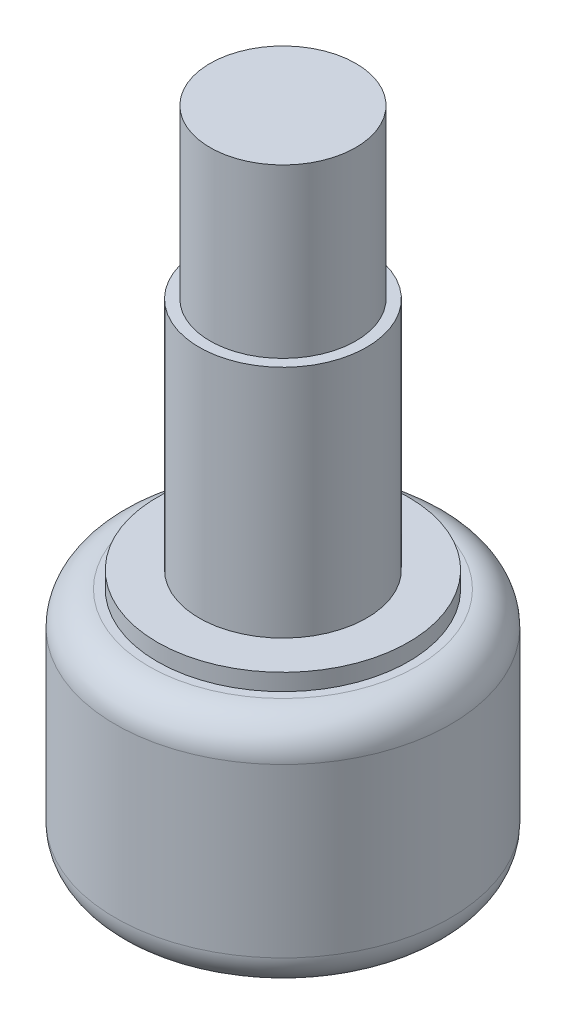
ISO-10303-21;
HEADER;
FILE_DESCRIPTION(('STEP AP214'),'2;1');
FILE_NAME('part.step','',(''),(''),'','','');
FILE_SCHEMA(('AUTOMOTIVE_DESIGN { 1 0 10303 214 1 1 1 1 }'));
ENDSEC;
DATA;
#1=APPLICATION_CONTEXT('core data for automotive mechanical design processes');
#2=APPLICATION_PROTOCOL_DEFINITION('international standard','automotive_design',2000,#1);
#3=PRODUCT_CONTEXT('',#1,'mechanical');
#4=PRODUCT('Part','Part','',(#3));
#5=PRODUCT_RELATED_PRODUCT_CATEGORY('part','',(#4));
#6=PRODUCT_DEFINITION_FORMATION('','',#4);
#7=PRODUCT_DEFINITION_CONTEXT('part definition',#1,'design');
#8=PRODUCT_DEFINITION('design','',#6,#7);
#9=PRODUCT_DEFINITION_SHAPE('','',#8);
#10=(LENGTH_UNIT() NAMED_UNIT(*) SI_UNIT(.MILLI.,.METRE.));
#11=(NAMED_UNIT(*) PLANE_ANGLE_UNIT() SI_UNIT($,.RADIAN.));
#12=(NAMED_UNIT(*) SI_UNIT($,.STERADIAN.) SOLID_ANGLE_UNIT());
#13=UNCERTAINTY_MEASURE_WITH_UNIT(LENGTH_MEASURE(1.E-05),#10,'distance_accuracy_value','');
#14=(GEOMETRIC_REPRESENTATION_CONTEXT(3) GLOBAL_UNCERTAINTY_ASSIGNED_CONTEXT((#13)) GLOBAL_UNIT_ASSIGNED_CONTEXT((#10,
#11,#12)) REPRESENTATION_CONTEXT('',''));
#15=CARTESIAN_POINT('',(0.,0.,0.));
#16=DIRECTION('',(0.,0.,1.));
#17=DIRECTION('',(1.,0.,0.));
#18=AXIS2_PLACEMENT_3D('',#15,#16,#17);
#19=CARTESIAN_POINT('',(-3.4544,30.95625,0.));
#20=DIRECTION('',(0.,1.,0.));
#21=DIRECTION('',(0.,0.,1.));
#22=AXIS2_PLACEMENT_3D('',#19,#20,#21);
#23=PLANE('',#22);
#24=CARTESIAN_POINT('',(0.,30.95625,0.));
#25=DIRECTION('',(0.,-1.,0.));
#26=DIRECTION('',(0.,0.,-1.));
#27=AXIS2_PLACEMENT_3D('',#24,#25,#26);
#28=CIRCLE('',#27,3.4544);
#29=CARTESIAN_POINT('',(0.,30.95625,-3.4544));
#30=VERTEX_POINT('',#29);
#31=EDGE_CURVE('E10',#30,#30,#28,.T.);
#32=ORIENTED_EDGE('',*,*,#31,.F.);
#33=EDGE_LOOP('',(#32));
#34=FACE_BOUND('',#33,.T.);
#35=ADVANCED_FACE('F30',(#34),#23,.T.);
#36=CARTESIAN_POINT('',(0.,0.,0.));
#37=DIRECTION('',(0.,-1.,0.));
#38=DIRECTION('',(0.,0.,-1.));
#39=AXIS2_PLACEMENT_3D('',#36,#37,#38);
#40=CYLINDRICAL_SURFACE('',#39,3.4544);
#41=ORIENTED_EDGE('',*,*,#31,.T.);
#42=EDGE_LOOP('',(#41));
#43=FACE_BOUND('',#42,.T.);
#44=CARTESIAN_POINT('',(0.,23.01875,0.));
#45=DIRECTION('',(0.,-1.,0.));
#46=DIRECTION('',(0.,0.,-1.));
#47=AXIS2_PLACEMENT_3D('',#44,#45,#46);
#48=CIRCLE('',#47,3.4544);
#49=CARTESIAN_POINT('',(0.,23.01875,-3.4544));
#50=VERTEX_POINT('',#49);
#51=EDGE_CURVE('E36',#50,#50,#48,.T.);
#52=ORIENTED_EDGE('',*,*,#51,.F.);
#53=EDGE_LOOP('',(#52));
#54=FACE_BOUND('',#53,.T.);
#55=ADVANCED_FACE('F88',(#43,#54),#40,.T.);
#56=CARTESIAN_POINT('',(-3.96875,23.01875,0.));
#57=DIRECTION('',(0.,1.,0.));
#58=DIRECTION('',(0.,0.,1.));
#59=AXIS2_PLACEMENT_3D('',#56,#57,#58);
#60=PLANE('',#59);
#61=ORIENTED_EDGE('',*,*,#51,.T.);
#62=EDGE_LOOP('',(#61));
#63=FACE_BOUND('',#62,.T.);
#64=CARTESIAN_POINT('',(0.,23.01875,0.));
#65=DIRECTION('',(0.,-1.,0.));
#66=DIRECTION('',(0.,0.,-1.));
#67=AXIS2_PLACEMENT_3D('',#64,#65,#66);
#68=CIRCLE('',#67,3.96875);
#69=CARTESIAN_POINT('',(0.,23.01875,-3.96875));
#70=VERTEX_POINT('',#69);
#71=EDGE_CURVE('E40',#70,#70,#68,.T.);
#72=ORIENTED_EDGE('',*,*,#71,.F.);
#73=EDGE_LOOP('',(#72));
#74=FACE_BOUND('',#73,.T.);
#75=ADVANCED_FACE('F93',(#63,#74),#60,.T.);
#76=CARTESIAN_POINT('',(0.,0.,0.));
#77=DIRECTION('',(0.,-1.,0.));
#78=DIRECTION('',(0.,0.,-1.));
#79=AXIS2_PLACEMENT_3D('',#76,#77,#78);
#80=CYLINDRICAL_SURFACE('',#79,3.96875);
#81=ORIENTED_EDGE('',*,*,#71,.T.);
#82=EDGE_LOOP('',(#81));
#83=FACE_BOUND('',#82,.T.);
#84=CARTESIAN_POINT('',(0.,11.90625,0.));
#85=DIRECTION('',(0.,-1.,0.));
#86=DIRECTION('',(0.,0.,-1.));
#87=AXIS2_PLACEMENT_3D('',#84,#85,#86);
#88=CIRCLE('',#87,3.96875);
#89=CARTESIAN_POINT('',(0.,11.90625,-3.96875));
#90=VERTEX_POINT('',#89);
#91=EDGE_CURVE('E44',#90,#90,#88,.T.);
#92=ORIENTED_EDGE('',*,*,#91,.F.);
#93=EDGE_LOOP('',(#92));
#94=FACE_BOUND('',#93,.T.);
#95=ADVANCED_FACE('F97',(#83,#94),#80,.T.);
#96=CARTESIAN_POINT('',(-5.953125,11.90625,0.));
#97=DIRECTION('',(0.,1.,0.));
#98=DIRECTION('',(0.,0.,1.));
#99=AXIS2_PLACEMENT_3D('',#96,#97,#98);
#100=PLANE('',#99);
#101=ORIENTED_EDGE('',*,*,#91,.T.);
#102=EDGE_LOOP('',(#101));
#103=FACE_BOUND('',#102,.T.);
#104=CARTESIAN_POINT('',(0.,11.90625,0.));
#105=DIRECTION('',(0.,-1.,0.));
#106=DIRECTION('',(0.,0.,-1.));
#107=AXIS2_PLACEMENT_3D('',#104,#105,#106);
#108=CIRCLE('',#107,5.953125);
#109=CARTESIAN_POINT('',(0.,11.90625,-5.953125));
#110=VERTEX_POINT('',#109);
#111=EDGE_CURVE('E49',#110,#110,#108,.T.);
#112=ORIENTED_EDGE('',*,*,#111,.F.);
#113=EDGE_LOOP('',(#112));
#114=FACE_BOUND('',#113,.T.);
#115=ADVANCED_FACE('F103',(#103,#114),#100,.T.);
#116=CARTESIAN_POINT('',(0.,0.,0.));
#117=DIRECTION('',(0.,-1.,0.));
#118=DIRECTION('',(0.,0.,-1.));
#119=AXIS2_PLACEMENT_3D('',#116,#117,#118);
#120=CYLINDRICAL_SURFACE('',#119,5.953125);
#121=ORIENTED_EDGE('',*,*,#111,.T.);
#122=EDGE_LOOP('',(#121));
#123=FACE_BOUND('',#122,.T.);
#124=CARTESIAN_POINT('',(0.,11.1125,0.));
#125=DIRECTION('',(0.,-1.,0.));
#126=DIRECTION('',(0.,0.,-1.));
#127=AXIS2_PLACEMENT_3D('',#124,#125,#126);
#128=CIRCLE('',#127,5.953125);
#129=CARTESIAN_POINT('',(0.,11.1125,-5.953125));
#130=VERTEX_POINT('',#129);
#131=EDGE_CURVE('E52',#130,#130,#128,.T.);
#132=ORIENTED_EDGE('',*,*,#131,.F.);
#133=EDGE_LOOP('',(#132));
#134=FACE_BOUND('',#133,.T.);
#135=ADVANCED_FACE('F107',(#123,#134),#120,.T.);
#136=CARTESIAN_POINT('',(-6.35,11.1125,0.));
#137=DIRECTION('',(0.,1.,0.));
#138=DIRECTION('',(0.,0.,1.));
#139=AXIS2_PLACEMENT_3D('',#136,#137,#138);
#140=PLANE('',#139);
#141=ORIENTED_EDGE('',*,*,#131,.T.);
#142=EDGE_LOOP('',(#141));
#143=FACE_BOUND('',#142,.T.);
#144=CARTESIAN_POINT('',(0.,11.1125,0.));
#145=DIRECTION('',(0.,-1.,0.));
#146=DIRECTION('',(0.,0.,-1.));
#147=AXIS2_PLACEMENT_3D('',#144,#145,#146);
#148=CIRCLE('',#147,6.35);
#149=CARTESIAN_POINT('',(0.,11.1125,-6.35));
#150=VERTEX_POINT('',#149);
#151=EDGE_CURVE('E55',#150,#150,#148,.T.);
#152=ORIENTED_EDGE('',*,*,#151,.F.);
#153=EDGE_LOOP('',(#152));
#154=FACE_BOUND('',#153,.T.);
#155=ADVANCED_FACE('F84',(#143,#154),#140,.T.);
#156=CARTESIAN_POINT('',(0.,9.525,0.));
#157=DIRECTION('',(0.,-1.,0.));
#158=DIRECTION('',(0.,0.,-1.));
#159=AXIS2_PLACEMENT_3D('',#156,#157,#158);
#160=TOROIDAL_SURFACE('',#159,6.35,1.5875);
#161=CARTESIAN_POINT('',(0.,9.525,0.));
#162=DIRECTION('',(0.,-1.,0.));
#163=DIRECTION('',(0.,0.,-1.));
#164=AXIS2_PLACEMENT_3D('',#161,#162,#163);
#165=CIRCLE('',#164,7.9375);
#166=CARTESIAN_POINT('',(0.,9.525,-7.9375));
#167=VERTEX_POINT('',#166);
#168=EDGE_CURVE('E58',#167,#167,#165,.T.);
#169=ORIENTED_EDGE('',*,*,#168,.F.);
#170=EDGE_LOOP('',(#169));
#171=FACE_BOUND('',#170,.T.);
#172=ORIENTED_EDGE('',*,*,#151,.T.);
#173=EDGE_LOOP('',(#172));
#174=FACE_BOUND('',#173,.T.);
#175=ADVANCED_FACE('F78',(#171,#174),#160,.T.);
#176=CARTESIAN_POINT('',(0.,0.,0.));
#177=DIRECTION('',(0.,-1.,0.));
#178=DIRECTION('',(0.,0.,-1.));
#179=AXIS2_PLACEMENT_3D('',#176,#177,#178);
#180=CYLINDRICAL_SURFACE('',#179,7.9375);
#181=ORIENTED_EDGE('',*,*,#168,.T.);
#182=EDGE_LOOP('',(#181));
#183=FACE_BOUND('',#182,.T.);
#184=CARTESIAN_POINT('',(0.,1.5875,0.));
#185=DIRECTION('',(0.,-1.,0.));
#186=DIRECTION('',(0.,0.,-1.));
#187=AXIS2_PLACEMENT_3D('',#184,#185,#186);
#188=CIRCLE('',#187,7.9375);
#189=CARTESIAN_POINT('',(0.,1.5875,-7.9375));
#190=VERTEX_POINT('',#189);
#191=EDGE_CURVE('E61',#190,#190,#188,.T.);
#192=ORIENTED_EDGE('',*,*,#191,.F.);
#193=EDGE_LOOP('',(#192));
#194=FACE_BOUND('',#193,.T.);
#195=ADVANCED_FACE('F73',(#183,#194),#180,.T.);
#196=CARTESIAN_POINT('',(0.,1.5875,0.));
#197=DIRECTION('',(0.,-1.,0.));
#198=DIRECTION('',(0.,0.,-1.));
#199=AXIS2_PLACEMENT_3D('',#196,#197,#198);
#200=TOROIDAL_SURFACE('',#199,6.35,1.5875);
#201=CARTESIAN_POINT('',(0.,0.,0.));
#202=DIRECTION('',(0.,-1.,0.));
#203=DIRECTION('',(0.,0.,-1.));
#204=AXIS2_PLACEMENT_3D('',#201,#202,#203);
#205=CIRCLE('',#204,6.35);
#206=CARTESIAN_POINT('',(0.,0.,-6.35));
#207=VERTEX_POINT('',#206);
#208=EDGE_CURVE('E64',#207,#207,#205,.T.);
#209=ORIENTED_EDGE('',*,*,#208,.F.);
#210=EDGE_LOOP('',(#209));
#211=FACE_BOUND('',#210,.T.);
#212=ORIENTED_EDGE('',*,*,#191,.T.);
#213=EDGE_LOOP('',(#212));
#214=FACE_BOUND('',#213,.T.);
#215=ADVANCED_FACE('F70',(#211,#214),#200,.T.);
#216=CARTESIAN_POINT('',(0.,0.,0.));
#217=DIRECTION('',(0.,-1.,0.));
#218=DIRECTION('',(0.,0.,-1.));
#219=AXIS2_PLACEMENT_3D('',#216,#217,#218);
#220=PLANE('',#219);
#221=ORIENTED_EDGE('',*,*,#208,.T.);
#222=EDGE_LOOP('',(#221));
#223=FACE_BOUND('',#222,.T.);
#224=ADVANCED_FACE('F68',(#223),#220,.T.);
#225=CLOSED_SHELL('',(#35,#55,#75,#95,#115,#135,#155,#175,#195,#215,#224));
#226=MANIFOLD_SOLID_BREP('B2',#225);
#227=ADVANCED_BREP_SHAPE_REPRESENTATION('',(#18,#226),#14);
#228=SHAPE_DEFINITION_REPRESENTATION(#9,#227);
ENDSEC;
END-ISO-10303-21;
